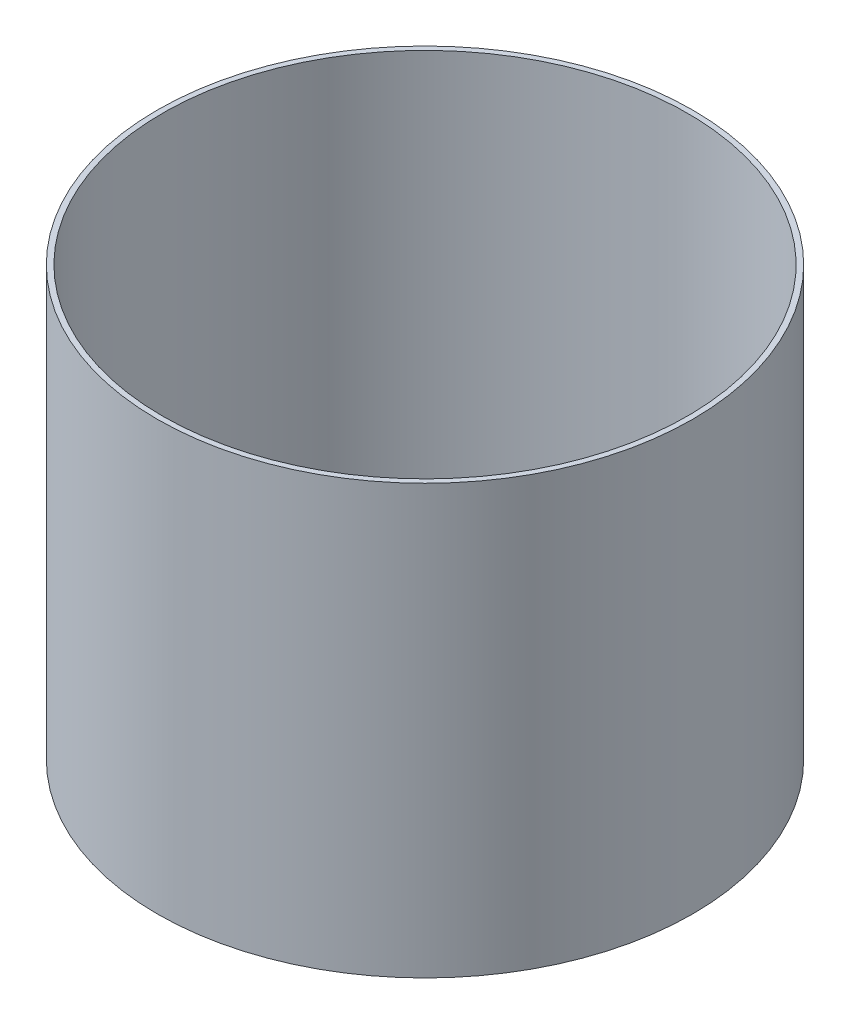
from build123d import *

# Parameters (mm, degrees)
SKETCH1_R           = 127
SKETCH1_R_2         = 124.46
INITIAL_GLASS_DEPTH = 203.2


with BuildPart() as part:
    # Sketch1 → Initial Glass (new body)
    with BuildSketch(Plane(origin=(0, 0, 0), x_dir=(1, 0, 0), z_dir=(0, 1, 0))):
        Circle(SKETCH1_R)
        Circle(SKETCH1_R_2, mode=Mode.SUBTRACT)
    extrude(amount=-INITIAL_GLASS_DEPTH)


solid = part.part
